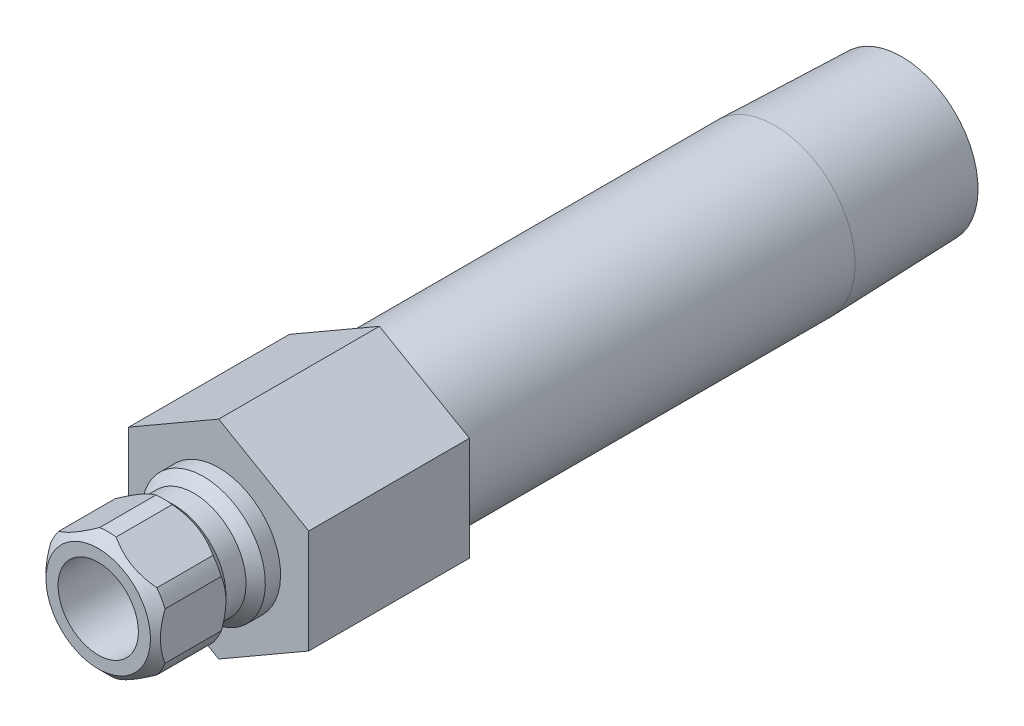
ISO-10303-21;
HEADER;
FILE_DESCRIPTION(('STEP AP214'),'2;1');
FILE_NAME('part.step','',(''),(''),'','','');
FILE_SCHEMA(('AUTOMOTIVE_DESIGN { 1 0 10303 214 1 1 1 1 }'));
ENDSEC;
DATA;
#1=APPLICATION_CONTEXT('core data for automotive mechanical design processes');
#2=APPLICATION_PROTOCOL_DEFINITION('international standard','automotive_design',2000,#1);
#3=PRODUCT_CONTEXT('',#1,'mechanical');
#4=PRODUCT('Part','Part','',(#3));
#5=PRODUCT_RELATED_PRODUCT_CATEGORY('part','',(#4));
#6=PRODUCT_DEFINITION_FORMATION('','',#4);
#7=PRODUCT_DEFINITION_CONTEXT('part definition',#1,'design');
#8=PRODUCT_DEFINITION('design','',#6,#7);
#9=PRODUCT_DEFINITION_SHAPE('','',#8);
#10=(LENGTH_UNIT() NAMED_UNIT(*) SI_UNIT(.MILLI.,.METRE.));
#11=(NAMED_UNIT(*) PLANE_ANGLE_UNIT() SI_UNIT($,.RADIAN.));
#12=(NAMED_UNIT(*) SI_UNIT($,.STERADIAN.) SOLID_ANGLE_UNIT());
#13=UNCERTAINTY_MEASURE_WITH_UNIT(LENGTH_MEASURE(1.E-05),#10,'distance_accuracy_value','');
#14=(GEOMETRIC_REPRESENTATION_CONTEXT(3) GLOBAL_UNCERTAINTY_ASSIGNED_CONTEXT((#13)) GLOBAL_UNIT_ASSIGNED_CONTEXT((#10,
#11,#12)) REPRESENTATION_CONTEXT('',''));
#15=CARTESIAN_POINT('',(0.,0.,0.));
#16=DIRECTION('',(0.,0.,1.));
#17=DIRECTION('',(1.,0.,0.));
#18=AXIS2_PLACEMENT_3D('',#15,#16,#17);
#19=CARTESIAN_POINT('',(0.,0.,0.));
#20=DIRECTION('',(0.,0.,-1.));
#21=DIRECTION('',(0.,1.,0.));
#22=AXIS2_PLACEMENT_3D('',#19,#20,#21);
#23=CYLINDRICAL_SURFACE('',#22,4.8895);
#24=DIRECTION('',(0.,0.,-1.));
#25=VECTOR('',#24,1.);
#26=CARTESIAN_POINT('',(3.87288738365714,-2.98461950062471,0.));
#27=LINE('',#26,#25);
#28=CARTESIAN_POINT('',(3.87288738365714,-2.98461950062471,4.318));
#29=VERTEX_POINT('',#28);
#30=CARTESIAN_POINT('',(3.87288738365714,-2.98461950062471,8.76299999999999));
#31=VERTEX_POINT('',#30);
#32=EDGE_CURVE('E392',#29,#31,#27,.F.);
#33=ORIENTED_EDGE('',*,*,#32,.F.);
#34=CARTESIAN_POINT('',(0.,0.,4.318));
#35=DIRECTION('',(0.,0.,-1.));
#36=DIRECTION('',(0.,1.,0.));
#37=AXIS2_PLACEMENT_3D('',#34,#35,#36);
#38=CIRCLE('',#37,4.8895);
#39=CARTESIAN_POINT('',(4.5212,-1.86170910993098,4.318));
#40=VERTEX_POINT('',#39);
#41=EDGE_CURVE('E369',#40,#29,#38,.T.);
#42=ORIENTED_EDGE('',*,*,#41,.F.);
#43=DIRECTION('',(0.,0.,-1.));
#44=VECTOR('',#43,1.);
#45=CARTESIAN_POINT('',(4.5212,-1.86170910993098,0.));
#46=LINE('',#45,#44);
#47=CARTESIAN_POINT('',(4.5212,-1.86170910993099,8.76299999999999));
#48=VERTEX_POINT('',#47);
#49=EDGE_CURVE('E383',#48,#40,#46,.T.);
#50=ORIENTED_EDGE('',*,*,#49,.F.);
#51=CARTESIAN_POINT('',(0.,0.,8.76299999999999));
#52=DIRECTION('',(0.,0.,-1.));
#53=DIRECTION('',(0.,1.,0.));
#54=AXIS2_PLACEMENT_3D('',#51,#52,#53);
#55=CIRCLE('',#54,4.8895);
#56=EDGE_CURVE('E191',#48,#31,#55,.T.);
#57=ORIENTED_EDGE('',*,*,#56,.T.);
#58=EDGE_LOOP('',(#33,#42,#50,#57));
#59=FACE_BOUND('',#58,.T.);
#60=ADVANCED_FACE('F34',(#59),#23,.T.);
#61=DIRECTION('',(0.,0.,-1.));
#62=VECTOR('',#61,1.);
#63=CARTESIAN_POINT('',(4.5212,1.86170910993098,0.));
#64=LINE('',#63,#62);
#65=CARTESIAN_POINT('',(4.5212,1.86170910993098,4.318));
#66=VERTEX_POINT('',#65);
#67=CARTESIAN_POINT('',(4.5212,1.86170910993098,8.76299999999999));
#68=VERTEX_POINT('',#67);
#69=EDGE_CURVE('E295',#66,#68,#64,.F.);
#70=ORIENTED_EDGE('',*,*,#69,.F.);
#71=CARTESIAN_POINT('',(3.87288738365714,2.98461950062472,4.318));
#72=VERTEX_POINT('',#71);
#73=EDGE_CURVE('E204',#72,#66,#38,.T.);
#74=ORIENTED_EDGE('',*,*,#73,.F.);
#75=DIRECTION('',(0.,0.,-1.));
#76=VECTOR('',#75,1.);
#77=CARTESIAN_POINT('',(3.87288738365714,2.98461950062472,0.));
#78=LINE('',#77,#76);
#79=CARTESIAN_POINT('',(3.87288738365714,2.98461950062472,8.76299999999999));
#80=VERTEX_POINT('',#79);
#81=EDGE_CURVE('E380',#80,#72,#78,.T.);
#82=ORIENTED_EDGE('',*,*,#81,.F.);
#83=EDGE_CURVE('E198',#80,#68,#55,.T.);
#84=ORIENTED_EDGE('',*,*,#83,.T.);
#85=EDGE_LOOP('',(#70,#74,#82,#84));
#86=FACE_BOUND('',#85,.T.);
#87=ADVANCED_FACE('F329',(#86),#23,.T.);
#88=DIRECTION('',(0.,0.,-1.));
#89=VECTOR('',#88,1.);
#90=CARTESIAN_POINT('',(0.648312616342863,4.84632861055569,0.));
#91=LINE('',#90,#89);
#92=CARTESIAN_POINT('',(0.648312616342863,4.84632861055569,4.318));
#93=VERTEX_POINT('',#92);
#94=CARTESIAN_POINT('',(0.648312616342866,4.84632861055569,8.76299999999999));
#95=VERTEX_POINT('',#94);
#96=EDGE_CURVE('E385',#93,#95,#91,.F.);
#97=ORIENTED_EDGE('',*,*,#96,.F.);
#98=CARTESIAN_POINT('',(-0.648312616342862,4.84632861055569,4.318));
#99=VERTEX_POINT('',#98);
#100=EDGE_CURVE('E200',#99,#93,#38,.T.);
#101=ORIENTED_EDGE('',*,*,#100,.F.);
#102=DIRECTION('',(0.,0.,-1.));
#103=VECTOR('',#102,1.);
#104=CARTESIAN_POINT('',(-0.648312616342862,4.84632861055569,0.));
#105=LINE('',#104,#103);
#106=CARTESIAN_POINT('',(-0.648312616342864,4.84632861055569,8.76299999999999));
#107=VERTEX_POINT('',#106);
#108=EDGE_CURVE('E361',#107,#99,#105,.T.);
#109=ORIENTED_EDGE('',*,*,#108,.F.);
#110=EDGE_CURVE('E193',#107,#95,#55,.T.);
#111=ORIENTED_EDGE('',*,*,#110,.T.);
#112=EDGE_LOOP('',(#97,#101,#109,#111));
#113=FACE_BOUND('',#112,.T.);
#114=ADVANCED_FACE('F334',(#113),#23,.T.);
#115=DIRECTION('',(0.,0.,-1.));
#116=VECTOR('',#115,1.);
#117=CARTESIAN_POINT('',(-3.87288738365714,2.98461950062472,0.));
#118=LINE('',#117,#116);
#119=CARTESIAN_POINT('',(-3.87288738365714,2.98461950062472,4.318));
#120=VERTEX_POINT('',#119);
#121=CARTESIAN_POINT('',(-3.87288738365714,2.98461950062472,8.76299999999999));
#122=VERTEX_POINT('',#121);
#123=EDGE_CURVE('E54',#120,#122,#118,.F.);
#124=ORIENTED_EDGE('',*,*,#123,.F.);
#125=CARTESIAN_POINT('',(-4.5212,1.86170910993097,4.318));
#126=VERTEX_POINT('',#125);
#127=EDGE_CURVE('E203',#126,#120,#38,.T.);
#128=ORIENTED_EDGE('',*,*,#127,.F.);
#129=DIRECTION('',(0.,0.,-1.));
#130=VECTOR('',#129,1.);
#131=CARTESIAN_POINT('',(-4.5212,1.86170910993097,0.));
#132=LINE('',#131,#130);
#133=CARTESIAN_POINT('',(-4.5212,1.86170910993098,8.763));
#134=VERTEX_POINT('',#133);
#135=EDGE_CURVE('E249',#134,#126,#132,.T.);
#136=ORIENTED_EDGE('',*,*,#135,.F.);
#137=EDGE_CURVE('E189',#134,#122,#55,.T.);
#138=ORIENTED_EDGE('',*,*,#137,.T.);
#139=EDGE_LOOP('',(#124,#128,#136,#138));
#140=FACE_BOUND('',#139,.T.);
#141=ADVANCED_FACE('F346',(#140),#23,.T.);
#142=DIRECTION('',(0.,0.,-1.));
#143=VECTOR('',#142,1.);
#144=CARTESIAN_POINT('',(-4.5212,-1.86170910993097,0.));
#145=LINE('',#144,#143);
#146=CARTESIAN_POINT('',(-4.5212,-1.86170910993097,4.318));
#147=VERTEX_POINT('',#146);
#148=CARTESIAN_POINT('',(-4.5212,-1.86170910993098,8.76299999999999));
#149=VERTEX_POINT('',#148);
#150=EDGE_CURVE('E62',#147,#149,#145,.F.);
#151=ORIENTED_EDGE('',*,*,#150,.F.);
#152=CARTESIAN_POINT('',(-3.87288738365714,-2.98461950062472,4.318));
#153=VERTEX_POINT('',#152);
#154=EDGE_CURVE('E182',#153,#147,#38,.T.);
#155=ORIENTED_EDGE('',*,*,#154,.F.);
#156=DIRECTION('',(0.,0.,-1.));
#157=VECTOR('',#156,1.);
#158=CARTESIAN_POINT('',(-3.87288738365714,-2.98461950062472,0.));
#159=LINE('',#158,#157);
#160=CARTESIAN_POINT('',(-3.87288738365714,-2.98461950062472,8.76299999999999));
#161=VERTEX_POINT('',#160);
#162=EDGE_CURVE('E165',#161,#153,#159,.T.);
#163=ORIENTED_EDGE('',*,*,#162,.F.);
#164=EDGE_CURVE('E180',#161,#149,#55,.T.);
#165=ORIENTED_EDGE('',*,*,#164,.T.);
#166=EDGE_LOOP('',(#151,#155,#163,#165));
#167=FACE_BOUND('',#166,.T.);
#168=ADVANCED_FACE('F179',(#167),#23,.T.);
#169=CARTESIAN_POINT('',(0.,0.,0.));
#170=DIRECTION('',(0.,0.,-1.));
#171=DIRECTION('',(0.,1.,0.));
#172=AXIS2_PLACEMENT_3D('',#169,#170,#171);
#173=CYLINDRICAL_SURFACE('',#172,6.35);
#174=CARTESIAN_POINT('',(0.,0.,-43.942));
#175=DIRECTION('',(0.,0.,-1.));
#176=DIRECTION('',(0.,1.,0.));
#177=AXIS2_PLACEMENT_3D('',#174,#175,#176);
#178=CIRCLE('',#177,6.34999999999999);
#179=CARTESIAN_POINT('',(0.,6.35,-43.942));
#180=VERTEX_POINT('',#179);
#181=EDGE_CURVE('E217',#180,#180,#178,.T.);
#182=ORIENTED_EDGE('',*,*,#181,.F.);
#183=EDGE_LOOP('',(#182));
#184=FACE_BOUND('',#183,.T.);
#185=CARTESIAN_POINT('',(0.,0.,-12.7));
#186=DIRECTION('',(0.,0.,1.));
#187=DIRECTION('',(1.,0.,0.));
#188=AXIS2_PLACEMENT_3D('',#185,#186,#187);
#189=CIRCLE('',#188,6.35);
#190=CARTESIAN_POINT('',(6.35,0.,-12.7));
#191=VERTEX_POINT('',#190);
#192=EDGE_CURVE('E438',#191,#191,#189,.F.);
#193=ORIENTED_EDGE('',*,*,#192,.T.);
#194=EDGE_LOOP('',(#193));
#195=FACE_BOUND('',#194,.T.);
#196=ADVANCED_FACE('F345',(#184,#195),#173,.T.);
#197=CARTESIAN_POINT('',(0.,6.03647060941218,-53.975));
#198=DIRECTION('',(0.,0.,-1.));
#199=DIRECTION('',(0.,1.,0.));
#200=AXIS2_PLACEMENT_3D('',#197,#198,#199);
#201=PLANE('',#200);
#202=CARTESIAN_POINT('',(0.,0.,-53.975));
#203=DIRECTION('',(0.,0.,-1.));
#204=DIRECTION('',(0.,1.,0.));
#205=AXIS2_PLACEMENT_3D('',#202,#203,#204);
#206=CIRCLE('',#205,6.03647060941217);
#207=CARTESIAN_POINT('',(0.,6.03647060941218,-53.975));
#208=VERTEX_POINT('',#207);
#209=EDGE_CURVE('E174',#208,#208,#206,.T.);
#210=ORIENTED_EDGE('',*,*,#209,.T.);
#211=EDGE_LOOP('',(#210));
#212=FACE_BOUND('',#211,.T.);
#213=CARTESIAN_POINT('',(0.,0.,-53.975));
#214=DIRECTION('',(0.,0.,-1.));
#215=DIRECTION('',(0.,1.,0.));
#216=AXIS2_PLACEMENT_3D('',#213,#214,#215);
#217=CIRCLE('',#216,4.62279999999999);
#218=CARTESIAN_POINT('',(0.,4.6228,-53.975));
#219=VERTEX_POINT('',#218);
#220=EDGE_CURVE('E450',#219,#219,#217,.T.);
#221=ORIENTED_EDGE('',*,*,#220,.F.);
#222=EDGE_LOOP('',(#221));
#223=FACE_BOUND('',#222,.T.);
#224=ADVANCED_FACE('F36',(#212,#223),#201,.T.);
#225=CARTESIAN_POINT('',(0.,0.,-53.975));
#226=DIRECTION('',(0.,0.,1.));
#227=DIRECTION('',(0.,-1.,0.));
#228=AXIS2_PLACEMENT_3D('',#225,#226,#227);
#229=CONICAL_SURFACE('',#228,6.03647060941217,0.0312396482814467);
#230=ORIENTED_EDGE('',*,*,#181,.T.);
#231=EDGE_LOOP('',(#230));
#232=FACE_BOUND('',#231,.T.);
#233=ORIENTED_EDGE('',*,*,#209,.F.);
#234=EDGE_LOOP('',(#233));
#235=FACE_BOUND('',#234,.T.);
#236=ADVANCED_FACE('F526',(#232,#235),#229,.T.);
#237=CARTESIAN_POINT('',(0.,4.8895,0.));
#238=DIRECTION('',(0.,0.,1.));
#239=DIRECTION('',(0.,-1.,0.));
#240=AXIS2_PLACEMENT_3D('',#237,#238,#239);
#241=PLANE('',#240);
#242=CARTESIAN_POINT('',(0.,0.,0.));
#243=DIRECTION('',(0.,0.,-1.));
#244=DIRECTION('',(0.,1.,0.));
#245=AXIS2_PLACEMENT_3D('',#242,#243,#244);
#246=CIRCLE('',#245,4.8895);
#247=CARTESIAN_POINT('',(0.,4.8895,0.));
#248=VERTEX_POINT('',#247);
#249=EDGE_CURVE('E214',#248,#248,#246,.T.);
#250=ORIENTED_EDGE('',*,*,#249,.T.);
#251=EDGE_LOOP('',(#250));
#252=FACE_BOUND('',#251,.T.);
#253=DIRECTION('',(-0.866025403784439,-0.5,0.));
#254=VECTOR('',#253,1.);
#255=CARTESIAN_POINT('',(0.,8.21223022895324,0.));
#256=LINE('',#255,#254);
#257=CARTESIAN_POINT('',(0.,8.21223022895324,0.));
#258=VERTEX_POINT('',#257);
#259=CARTESIAN_POINT('',(-7.112,4.10611511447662,0.));
#260=VERTEX_POINT('',#259);
#261=EDGE_CURVE('E395',#258,#260,#256,.T.);
#262=ORIENTED_EDGE('',*,*,#261,.T.);
#263=DIRECTION('',(0.,-1.,0.));
#264=VECTOR('',#263,1.);
#265=CARTESIAN_POINT('',(-7.112,4.10611511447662,0.));
#266=LINE('',#265,#264);
#267=CARTESIAN_POINT('',(-7.112,-4.10611511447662,0.));
#268=VERTEX_POINT('',#267);
#269=EDGE_CURVE('E422',#260,#268,#266,.T.);
#270=ORIENTED_EDGE('',*,*,#269,.T.);
#271=DIRECTION('',(0.866025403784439,-0.5,0.));
#272=VECTOR('',#271,1.);
#273=CARTESIAN_POINT('',(-7.112,-4.10611511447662,0.));
#274=LINE('',#273,#272);
#275=CARTESIAN_POINT('',(0.,-8.21223022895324,0.));
#276=VERTEX_POINT('',#275);
#277=EDGE_CURVE('E425',#268,#276,#274,.T.);
#278=ORIENTED_EDGE('',*,*,#277,.T.);
#279=DIRECTION('',(0.866025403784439,0.5,0.));
#280=VECTOR('',#279,1.);
#281=CARTESIAN_POINT('',(0.,-8.21223022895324,0.));
#282=LINE('',#281,#280);
#283=CARTESIAN_POINT('',(7.112,-4.10611511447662,0.));
#284=VERTEX_POINT('',#283);
#285=EDGE_CURVE('E428',#276,#284,#282,.T.);
#286=ORIENTED_EDGE('',*,*,#285,.T.);
#287=DIRECTION('',(0.,1.,0.));
#288=VECTOR('',#287,1.);
#289=CARTESIAN_POINT('',(7.112,-4.10611511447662,0.));
#290=LINE('',#289,#288);
#291=CARTESIAN_POINT('',(7.112,4.10611511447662,0.));
#292=VERTEX_POINT('',#291);
#293=EDGE_CURVE('E431',#284,#292,#290,.T.);
#294=ORIENTED_EDGE('',*,*,#293,.T.);
#295=DIRECTION('',(-0.866025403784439,0.5,0.));
#296=VECTOR('',#295,1.);
#297=CARTESIAN_POINT('',(7.112,4.10611511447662,0.));
#298=LINE('',#297,#296);
#299=EDGE_CURVE('E404',#292,#258,#298,.T.);
#300=ORIENTED_EDGE('',*,*,#299,.T.);
#301=EDGE_LOOP('',(#262,#270,#278,#286,#294,#300));
#302=FACE_BOUND('',#301,.T.);
#303=ADVANCED_FACE('F523',(#252,#302),#241,.T.);
#304=CARTESIAN_POINT('',(0.,0.,0.));
#305=DIRECTION('',(0.,0.,-1.));
#306=DIRECTION('',(0.,1.,0.));
#307=AXIS2_PLACEMENT_3D('',#304,#305,#306);
#308=CYLINDRICAL_SURFACE('',#307,4.8895);
#309=CARTESIAN_POINT('',(0.,0.,1.2065));
#310=DIRECTION('',(0.,0.,-1.));
#311=DIRECTION('',(0.,1.,0.));
#312=AXIS2_PLACEMENT_3D('',#309,#310,#311);
#313=CIRCLE('',#312,4.8895);
#314=CARTESIAN_POINT('',(0.,4.8895,1.2065));
#315=VERTEX_POINT('',#314);
#316=EDGE_CURVE('E211',#315,#315,#313,.T.);
#317=ORIENTED_EDGE('',*,*,#316,.T.);
#318=EDGE_LOOP('',(#317));
#319=FACE_BOUND('',#318,.T.);
#320=ORIENTED_EDGE('',*,*,#249,.F.);
#321=EDGE_LOOP('',(#320));
#322=FACE_BOUND('',#321,.T.);
#323=ADVANCED_FACE('F525',(#319,#322),#308,.T.);
#324=CARTESIAN_POINT('',(0.,0.,1.2065));
#325=DIRECTION('',(0.,0.,-1.));
#326=DIRECTION('',(0.,1.,0.));
#327=AXIS2_PLACEMENT_3D('',#324,#325,#326);
#328=CONICAL_SURFACE('',#327,4.8895,0.785398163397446);
#329=CARTESIAN_POINT('',(0.,0.,1.9685));
#330=DIRECTION('',(0.,0.,-1.));
#331=DIRECTION('',(0.,1.,0.));
#332=AXIS2_PLACEMENT_3D('',#329,#330,#331);
#333=CIRCLE('',#332,4.1275);
#334=CARTESIAN_POINT('',(0.,4.1275,1.9685));
#335=VERTEX_POINT('',#334);
#336=EDGE_CURVE('E208',#335,#335,#333,.T.);
#337=ORIENTED_EDGE('',*,*,#336,.T.);
#338=EDGE_LOOP('',(#337));
#339=FACE_BOUND('',#338,.T.);
#340=ORIENTED_EDGE('',*,*,#316,.F.);
#341=EDGE_LOOP('',(#340));
#342=FACE_BOUND('',#341,.T.);
#343=ADVANCED_FACE('F533',(#339,#342),#328,.T.);
#344=CARTESIAN_POINT('',(0.,0.,0.));
#345=DIRECTION('',(0.,0.,-1.));
#346=DIRECTION('',(0.,1.,0.));
#347=AXIS2_PLACEMENT_3D('',#344,#345,#346);
#348=CYLINDRICAL_SURFACE('',#347,4.1275);
#349=CARTESIAN_POINT('',(0.,0.,3.556));
#350=DIRECTION('',(0.,0.,-1.));
#351=DIRECTION('',(0.,1.,0.));
#352=AXIS2_PLACEMENT_3D('',#349,#350,#351);
#353=CIRCLE('',#352,4.1275);
#354=CARTESIAN_POINT('',(0.,4.1275,3.556));
#355=VERTEX_POINT('',#354);
#356=EDGE_CURVE('E205',#355,#355,#353,.T.);
#357=ORIENTED_EDGE('',*,*,#356,.T.);
#358=EDGE_LOOP('',(#357));
#359=FACE_BOUND('',#358,.T.);
#360=ORIENTED_EDGE('',*,*,#336,.F.);
#361=EDGE_LOOP('',(#360));
#362=FACE_BOUND('',#361,.T.);
#363=ADVANCED_FACE('F256',(#359,#362),#348,.T.);
#364=CARTESIAN_POINT('',(0.,0.,3.556));
#365=DIRECTION('',(0.,0.,1.));
#366=DIRECTION('',(0.,-1.,0.));
#367=AXIS2_PLACEMENT_3D('',#364,#365,#366);
#368=CONICAL_SURFACE('',#367,4.1275,0.785398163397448);
#369=CARTESIAN_POINT('',(0.64785777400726,-4.84659121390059,4.3182));
#370=CARTESIAN_POINT('',(0.775261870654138,-4.77303442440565,4.26213711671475));
#371=CARTESIAN_POINT('',(0.904457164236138,-4.69844348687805,4.21102627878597));
#372=CARTESIAN_POINT('',(1.16629518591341,-4.5472712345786,4.12074318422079));
#373=CARTESIAN_POINT('',(1.2989462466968,-4.47068510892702,4.08160338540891));
#374=CARTESIAN_POINT('',(1.56203676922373,-4.31878972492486,4.01877592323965));
#375=CARTESIAN_POINT('',(1.69238331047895,-4.24353411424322,3.99458163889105));
#376=CARTESIAN_POINT('',(1.95434729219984,-4.09228913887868,3.96102228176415));
#377=CARTESIAN_POINT('',(2.0859628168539,-4.01630088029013,3.951637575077));
#378=CARTESIAN_POINT('',(2.35623055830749,-3.86026172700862,3.9482192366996));
#379=CARTESIAN_POINT('',(2.49489129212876,-3.78020591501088,3.95501290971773));
#380=CARTESIAN_POINT('',(2.77103341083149,-3.62077518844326,3.98518499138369));
#381=CARTESIAN_POINT('',(2.90851272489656,-3.54140146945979,4.00858815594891));
#382=CARTESIAN_POINT('',(3.18622016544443,-3.38106700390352,4.07155129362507));
#383=CARTESIAN_POINT('',(3.32634361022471,-3.30016669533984,4.11171074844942));
#384=CARTESIAN_POINT('',(3.60275664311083,-3.14057955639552,4.20550294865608));
#385=CARTESIAN_POINT('',(3.73905611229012,-3.06188702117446,4.25909654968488));
#386=CARTESIAN_POINT('',(3.87334222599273,-2.98435689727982,4.3182));
#387=B_SPLINE_CURVE_WITH_KNOTS('',3,(#369,#370,#371,#372,#373,#374,#375,#376,#377,#378,#379,
#380,#381,#382,#383,#384,#385,#386),.UNSPECIFIED.,.F.,.F.,(4,2,2,2,2,2,2,2,4),(0.,
0.472469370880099,0.946208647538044,1.40285320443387,1.85889185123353,2.33874707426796,
2.81931901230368,3.31879975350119,3.81684169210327),.UNSPECIFIED.);
#388=CARTESIAN_POINT('',(0.648312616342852,-4.84632861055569,4.318));
#389=VERTEX_POINT('',#388);
#390=EDGE_CURVE('E394',#389,#29,#387,.T.);
#391=ORIENTED_EDGE('',*,*,#390,.F.);
#392=CARTESIAN_POINT('',(-0.648312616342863,-4.84632861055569,4.318));
#393=VERTEX_POINT('',#392);
#394=EDGE_CURVE('E367',#389,#393,#38,.T.);
#395=ORIENTED_EDGE('',*,*,#394,.T.);
#396=CARTESIAN_POINT('',(-3.87334222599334,-2.98435689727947,4.31820000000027));
#397=CARTESIAN_POINT('',(-3.74593812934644,-3.05791368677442,4.26213711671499));
#398=CARTESIAN_POINT('',(-3.61674283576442,-3.13250462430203,4.21102627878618));
#399=CARTESIAN_POINT('',(-3.35490481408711,-3.28367687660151,4.12074318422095));
#400=CARTESIAN_POINT('',(-3.22225375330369,-3.3602630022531,4.08160338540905));
#401=CARTESIAN_POINT('',(-2.95916323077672,-3.51215838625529,4.01877592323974));
#402=CARTESIAN_POINT('',(-2.82881668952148,-3.58741399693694,3.99458163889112));
#403=CARTESIAN_POINT('',(-2.56685270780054,-3.73865897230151,3.96102228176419));
#404=CARTESIAN_POINT('',(-2.43523718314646,-3.81464723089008,3.95163757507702));
#405=CARTESIAN_POINT('',(-2.16496944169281,-3.97068638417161,3.94821923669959));
#406=CARTESIAN_POINT('',(-2.02630870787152,-4.05074219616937,3.95501290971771));
#407=CARTESIAN_POINT('',(-1.75016658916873,-4.21017292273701,3.98518499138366));
#408=CARTESIAN_POINT('',(-1.61268727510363,-4.28954664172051,4.00858815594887));
#409=CARTESIAN_POINT('',(-1.33497983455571,-4.44988110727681,4.07155129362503));
#410=CARTESIAN_POINT('',(-1.1948563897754,-4.5307814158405,4.11171074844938));
#411=CARTESIAN_POINT('',(-0.918443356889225,-4.69036855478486,4.20550294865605));
#412=CARTESIAN_POINT('',(-0.782143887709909,-4.76906109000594,4.25909654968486));
#413=CARTESIAN_POINT('',(-0.647857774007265,-4.84659121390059,4.3182));
#414=B_SPLINE_CURVE_WITH_KNOTS('',3,(#396,#397,#398,#399,#400,#401,#402,#403,#404,#405,#406,
#407,#408,#409,#410,#411,#412,#413),.UNSPECIFIED.,.F.,.F.,(4,2,2,2,2,2,2,2,4),(0.,
0.472469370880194,0.946208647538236,1.40285320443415,1.85889185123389,2.33874707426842,
2.81931901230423,3.31879975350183,3.81684169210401),.UNSPECIFIED.);
#415=EDGE_CURVE('E242',#153,#393,#414,.T.);
#416=ORIENTED_EDGE('',*,*,#415,.F.);
#417=ORIENTED_EDGE('',*,*,#154,.T.);
#418=CARTESIAN_POINT('',(-4.5212,-5.15925306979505,6.2884665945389));
#419=CARTESIAN_POINT('',(-4.5212,-5.03341781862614,6.19384981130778));
#420=CARTESIAN_POINT('',(-4.5212,-4.90687282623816,6.10016148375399));
#421=CARTESIAN_POINT('',(-4.5212,-4.65208542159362,5.91505573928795));
#422=CARTESIAN_POINT('',(-4.5212,-4.52384258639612,5.82363890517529));
#423=CARTESIAN_POINT('',(-4.5212,-4.26444371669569,5.64284060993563));
#424=CARTESIAN_POINT('',(-4.5212,-4.13327280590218,5.55348041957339));
#425=CARTESIAN_POINT('',(-4.5212,-3.86869655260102,5.37814219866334));
#426=CARTESIAN_POINT('',(-4.5212,-3.735291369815,5.29216392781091));
#427=CARTESIAN_POINT('',(-4.5212,-3.45835736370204,5.1196421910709));
#428=CARTESIAN_POINT('',(-4.5212,-3.31467977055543,5.03333631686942));
#429=CARTESIAN_POINT('',(-4.5212,-3.02397608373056,4.86646929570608));
#430=CARTESIAN_POINT('',(-4.5212,-2.87694947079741,4.78590904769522));
#431=CARTESIAN_POINT('',(-4.5212,-2.57957206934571,4.6322757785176));
#432=CARTESIAN_POINT('',(-4.5212,-2.42923274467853,4.55918074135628));
#433=CARTESIAN_POINT('',(-4.5212,-2.12448469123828,4.4221138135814));
#434=CARTESIAN_POINT('',(-4.5212,-1.97007782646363,4.35813782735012));
#435=CARTESIAN_POINT('',(-4.5212,-1.66898205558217,4.24604782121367));
#436=CARTESIAN_POINT('',(-4.5212,-1.52260919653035,4.19709368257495));
#437=CARTESIAN_POINT('',(-4.5212,-1.22638031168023,4.11093488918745));
#438=CARTESIAN_POINT('',(-4.5212,-1.07652404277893,4.07373105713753));
#439=CARTESIAN_POINT('',(-4.5212,-0.776693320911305,4.01362130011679));
#440=CARTESIAN_POINT('',(-4.5212,-0.6267682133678,3.99047322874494));
#441=CARTESIAN_POINT('',(-4.5212,-0.32536672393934,3.95891692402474));
#442=CARTESIAN_POINT('',(-4.5212,-0.173890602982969,3.95050625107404));
#443=CARTESIAN_POINT('',(-4.5212,0.123852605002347,3.94903068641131));
#444=CARTESIAN_POINT('',(-4.5212,0.270117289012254,3.95544130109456));
#445=CARTESIAN_POINT('',(-4.5212,0.561370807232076,3.98210770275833));
#446=CARTESIAN_POINT('',(-4.5212,0.706359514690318,4.00236484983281));
#447=CARTESIAN_POINT('',(-4.5212,0.996462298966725,4.05597163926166));
#448=CARTESIAN_POINT('',(-4.5212,1.14153485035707,4.08954247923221));
#449=CARTESIAN_POINT('',(-4.5212,1.42852462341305,4.16800024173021));
#450=CARTESIAN_POINT('',(-4.5212,1.5704421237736,4.21288616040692));
#451=CARTESIAN_POINT('',(-4.5212,1.86505501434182,4.3171412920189));
#452=CARTESIAN_POINT('',(-4.5212,2.01739126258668,4.37751543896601));
#453=CARTESIAN_POINT('',(-4.5212,2.31809735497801,4.5075182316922));
#454=CARTESIAN_POINT('',(-4.5212,2.46646529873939,4.57715121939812));
#455=CARTESIAN_POINT('',(-4.5212,2.75996557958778,4.72401353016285));
#456=CARTESIAN_POINT('',(-4.5212,2.90508583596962,4.80126680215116));
#457=CARTESIAN_POINT('',(-4.5212,3.19198335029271,4.96166050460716));
#458=CARTESIAN_POINT('',(-4.5212,3.33376113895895,5.04479999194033));
#459=CARTESIAN_POINT('',(-4.5212,3.6074215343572,5.21154136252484));
#460=CARTESIAN_POINT('',(-4.5212,3.73944496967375,5.29491333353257));
#461=CARTESIAN_POINT('',(-4.5212,4.00122581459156,5.46515273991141));
#462=CARTESIAN_POINT('',(-4.5212,4.13098305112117,5.55202044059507));
#463=CARTESIAN_POINT('',(-4.5212,4.38747396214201,5.7279062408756));
#464=CARTESIAN_POINT('',(-4.5212,4.51422365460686,5.81690106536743));
#465=CARTESIAN_POINT('',(-4.5212,4.76599253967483,5.99723636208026));
#466=CARTESIAN_POINT('',(-4.5212,4.89101219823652,6.08857618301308));
#467=CARTESIAN_POINT('',(-4.5212,5.01530771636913,6.18087446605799));
#468=B_SPLINE_CURVE_WITH_KNOTS('',3,(#418,#419,#420,#421,#422,#423,#424,#425,#426,#427,#428,
#429,#430,#431,#432,#433,#434,#435,#436,#437,#438,#439,#440,#441,#442,#443,#444,#445,#446,#447,
#448,#449,#450,#451,#452,#453,#454,#455,#456,#457,#458,#459,#460,#461,#462,#463,#464,#465,#466,
#467),.UNSPECIFIED.,.F.,.F.,(4,2,2,2,2,2,2,2,2,2,2,2,2,2,2,2,2,2,2,2,2,2,2,2,4),(0.,
0.472324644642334,0.944769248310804,1.42087610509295,1.89694907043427,2.39966187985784,
2.90245317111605,3.40371602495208,3.90475303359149,4.36737130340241,4.8300219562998,
5.28445770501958,5.73881822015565,6.17734710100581,6.61591906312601,7.06210522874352,
7.50825182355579,7.99945943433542,8.49089821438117,8.98393391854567,9.4768908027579,
9.94525924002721,10.4136632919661,10.8782525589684,11.3427141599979),.UNSPECIFIED.);
#469=EDGE_CURVE('E265',#126,#147,#468,.F.);
#470=ORIENTED_EDGE('',*,*,#469,.F.);
#471=ORIENTED_EDGE('',*,*,#127,.T.);
#472=CARTESIAN_POINT('',(-0.647857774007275,4.84659121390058,4.3182));
#473=CARTESIAN_POINT('',(-0.775261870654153,4.77303442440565,4.26213711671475));
#474=CARTESIAN_POINT('',(-0.904457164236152,4.69844348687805,4.21102627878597));
#475=CARTESIAN_POINT('',(-1.16629518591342,4.5472712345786,4.12074318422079));
#476=CARTESIAN_POINT('',(-1.29894624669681,4.47068510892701,4.08160338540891));
#477=CARTESIAN_POINT('',(-1.56203676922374,4.31878972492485,4.01877592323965));
#478=CARTESIAN_POINT('',(-1.69238331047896,4.24353411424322,3.99458163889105));
#479=CARTESIAN_POINT('',(-1.95434729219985,4.09228913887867,3.96102228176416));
#480=CARTESIAN_POINT('',(-2.0859628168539,4.01630088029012,3.95163757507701));
#481=CARTESIAN_POINT('',(-2.35623055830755,3.86026172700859,3.94821923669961));
#482=CARTESIAN_POINT('',(-2.49489129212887,3.78020591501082,3.95501290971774));
#483=CARTESIAN_POINT('',(-2.7710334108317,3.62077518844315,3.98518499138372));
#484=CARTESIAN_POINT('',(-2.90851272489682,3.54140146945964,4.00858815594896));
#485=CARTESIAN_POINT('',(-3.18622016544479,3.38106700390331,4.07155129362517));
#486=CARTESIAN_POINT('',(-3.32634361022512,3.30016669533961,4.11171074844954));
#487=CARTESIAN_POINT('',(-3.60275664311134,3.14057955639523,4.20550294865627));
#488=CARTESIAN_POINT('',(-3.73905611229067,3.06188702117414,4.2590965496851));
#489=CARTESIAN_POINT('',(-3.87334222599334,2.98435689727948,4.31820000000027));
#490=B_SPLINE_CURVE_WITH_KNOTS('',3,(#472,#473,#474,#475,#476,#477,#478,#479,#480,#481,#482,
#483,#484,#485,#486,#487,#488,#489),.UNSPECIFIED.,.F.,.F.,(4,2,2,2,2,2,2,2,4),(0.,
0.472469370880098,0.946208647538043,1.40285320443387,1.85889185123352,2.33874707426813,
2.81931901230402,3.31879975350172,3.81684169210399),.UNSPECIFIED.);
#491=EDGE_CURVE('E272',#99,#120,#490,.T.);
#492=ORIENTED_EDGE('',*,*,#491,.F.);
#493=ORIENTED_EDGE('',*,*,#100,.T.);
#494=CARTESIAN_POINT('',(3.87334222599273,2.98435689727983,4.3182));
#495=CARTESIAN_POINT('',(3.74593812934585,3.05791368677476,4.26213711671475));
#496=CARTESIAN_POINT('',(3.61674283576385,3.13250462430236,4.21102627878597));
#497=CARTESIAN_POINT('',(3.35490481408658,3.28367687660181,4.12074318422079));
#498=CARTESIAN_POINT('',(3.22225375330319,3.36026300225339,4.08160338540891));
#499=CARTESIAN_POINT('',(2.95916323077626,3.51215838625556,4.01877592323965));
#500=CARTESIAN_POINT('',(2.82881668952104,3.58741399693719,3.99458163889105));
#501=CARTESIAN_POINT('',(2.56685270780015,3.73865897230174,3.96102228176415));
#502=CARTESIAN_POINT('',(2.4352371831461,3.81464723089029,3.95163757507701));
#503=CARTESIAN_POINT('',(2.16496944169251,3.97068638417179,3.94821923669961));
#504=CARTESIAN_POINT('',(2.02630870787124,4.05074219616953,3.95501290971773));
#505=CARTESIAN_POINT('',(1.75016658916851,4.21017292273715,3.98518499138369));
#506=CARTESIAN_POINT('',(1.61268727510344,4.28954664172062,4.00858815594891));
#507=CARTESIAN_POINT('',(1.33497983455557,4.44988110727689,4.07155129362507));
#508=CARTESIAN_POINT('',(1.19485638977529,4.53078141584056,4.11171074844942));
#509=CARTESIAN_POINT('',(0.918443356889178,4.69036855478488,4.20550294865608));
#510=CARTESIAN_POINT('',(0.78214388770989,4.76906109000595,4.25909654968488));
#511=CARTESIAN_POINT('',(0.647857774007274,4.84659121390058,4.3182));
#512=B_SPLINE_CURVE_WITH_KNOTS('',3,(#494,#495,#496,#497,#498,#499,#500,#501,#502,#503,#504,
#505,#506,#507,#508,#509,#510,#511),.UNSPECIFIED.,.F.,.F.,(4,2,2,2,2,2,2,2,4),(0.,
0.472469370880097,0.946208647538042,1.40285320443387,1.85889185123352,2.33874707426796,
2.81931901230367,3.31879975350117,3.81684169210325),.UNSPECIFIED.);
#513=EDGE_CURVE('E279',#72,#93,#512,.T.);
#514=ORIENTED_EDGE('',*,*,#513,.F.);
#515=ORIENTED_EDGE('',*,*,#73,.T.);
#516=CARTESIAN_POINT('',(4.5212,-5.15925306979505,6.2884665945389));
#517=CARTESIAN_POINT('',(4.5212,-5.03341781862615,6.19384981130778));
#518=CARTESIAN_POINT('',(4.5212,-4.90687282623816,6.10016148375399));
#519=CARTESIAN_POINT('',(4.5212,-4.65208542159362,5.91505573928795));
#520=CARTESIAN_POINT('',(4.5212,-4.52384258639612,5.82363890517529));
#521=CARTESIAN_POINT('',(4.5212,-4.26444371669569,5.64284060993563));
#522=CARTESIAN_POINT('',(4.5212,-4.13327280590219,5.55348041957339));
#523=CARTESIAN_POINT('',(4.5212,-3.86869655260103,5.37814219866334));
#524=CARTESIAN_POINT('',(4.5212,-3.735291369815,5.29216392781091));
#525=CARTESIAN_POINT('',(4.5212,-3.45835736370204,5.1196421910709));
#526=CARTESIAN_POINT('',(4.5212,-3.31467977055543,5.03333631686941));
#527=CARTESIAN_POINT('',(4.5212,-3.02397608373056,4.86646929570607));
#528=CARTESIAN_POINT('',(4.5212,-2.87694947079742,4.78590904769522));
#529=CARTESIAN_POINT('',(4.5212,-2.57957206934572,4.6322757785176));
#530=CARTESIAN_POINT('',(4.5212,-2.42923274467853,4.55918074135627));
#531=CARTESIAN_POINT('',(4.5212,-2.12448469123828,4.4221138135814));
#532=CARTESIAN_POINT('',(4.5212,-1.97007782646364,4.35813782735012));
#533=CARTESIAN_POINT('',(4.5212,-1.66898205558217,4.24604782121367));
#534=CARTESIAN_POINT('',(4.5212,-1.52260919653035,4.19709368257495));
#535=CARTESIAN_POINT('',(4.5212,-1.22638031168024,4.11093488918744));
#536=CARTESIAN_POINT('',(4.5212,-1.07652404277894,4.07373105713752));
#537=CARTESIAN_POINT('',(4.5212,-0.776693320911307,4.01362130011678));
#538=CARTESIAN_POINT('',(4.5212,-0.626768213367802,3.99047322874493));
#539=CARTESIAN_POINT('',(4.5212,-0.325366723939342,3.95891692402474));
#540=CARTESIAN_POINT('',(4.5212,-0.173890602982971,3.95050625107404));
#541=CARTESIAN_POINT('',(4.5212,0.123852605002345,3.94903068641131));
#542=CARTESIAN_POINT('',(4.5212,0.270117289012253,3.95544130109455));
#543=CARTESIAN_POINT('',(4.5212,0.561370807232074,3.98210770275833));
#544=CARTESIAN_POINT('',(4.5212,0.706359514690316,4.0023648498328));
#545=CARTESIAN_POINT('',(4.5212,0.996462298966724,4.05597163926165));
#546=CARTESIAN_POINT('',(4.5212,1.14153485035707,4.08954247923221));
#547=CARTESIAN_POINT('',(4.5212,1.42852462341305,4.16800024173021));
#548=CARTESIAN_POINT('',(4.5212,1.5704421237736,4.21288616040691));
#549=CARTESIAN_POINT('',(4.5212,1.86505501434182,4.3171412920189));
#550=CARTESIAN_POINT('',(4.5212,2.01739126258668,4.37751543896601));
#551=CARTESIAN_POINT('',(4.5212,2.31809735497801,4.5075182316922));
#552=CARTESIAN_POINT('',(4.5212,2.46646529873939,4.57715121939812));
#553=CARTESIAN_POINT('',(4.5212,2.75996557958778,4.72401353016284));
#554=CARTESIAN_POINT('',(4.5212,2.90508583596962,4.80126680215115));
#555=CARTESIAN_POINT('',(4.5212,3.19198335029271,4.96166050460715));
#556=CARTESIAN_POINT('',(4.5212,3.33376113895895,5.04479999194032));
#557=CARTESIAN_POINT('',(4.5212,3.6074215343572,5.21154136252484));
#558=CARTESIAN_POINT('',(4.5212,3.73944496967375,5.29491333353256));
#559=CARTESIAN_POINT('',(4.5212,4.00122581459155,5.4651527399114));
#560=CARTESIAN_POINT('',(4.5212,4.13098305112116,5.55202044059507));
#561=CARTESIAN_POINT('',(4.5212,4.38747396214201,5.72790624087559));
#562=CARTESIAN_POINT('',(4.5212,4.51422365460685,5.81690106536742));
#563=CARTESIAN_POINT('',(4.5212,4.76599253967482,5.99723636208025));
#564=CARTESIAN_POINT('',(4.5212,4.89101219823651,6.08857618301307));
#565=CARTESIAN_POINT('',(4.5212,5.01530771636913,6.18087446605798));
#566=B_SPLINE_CURVE_WITH_KNOTS('',3,(#516,#517,#518,#519,#520,#521,#522,#523,#524,#525,#526,
#527,#528,#529,#530,#531,#532,#533,#534,#535,#536,#537,#538,#539,#540,#541,#542,#543,#544,#545,
#546,#547,#548,#549,#550,#551,#552,#553,#554,#555,#556,#557,#558,#559,#560,#561,#562,#563,#564,
#565),.UNSPECIFIED.,.F.,.F.,(4,2,2,2,2,2,2,2,2,2,2,2,2,2,2,2,2,2,2,2,2,2,2,2,4),(0.,
0.472324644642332,0.944769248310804,1.42087610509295,1.89694907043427,2.39966187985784,
2.90245317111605,3.40371602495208,3.90475303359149,4.36737130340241,4.8300219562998,
5.28445770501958,5.73881822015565,6.17734710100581,6.61591906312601,7.06210522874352,
7.50825182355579,7.99945943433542,8.49089821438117,8.98393391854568,9.47689080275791,
9.94525924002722,10.4136632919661,10.8782525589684,11.3427141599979),.UNSPECIFIED.);
#567=EDGE_CURVE('E287',#40,#66,#566,.T.);
#568=ORIENTED_EDGE('',*,*,#567,.F.);
#569=ORIENTED_EDGE('',*,*,#41,.T.);
#570=EDGE_LOOP('',(#391,#395,#416,#417,#470,#471,#492,#493,#514,#515,#568,#569));
#571=FACE_BOUND('',#570,.T.);
#572=ORIENTED_EDGE('',*,*,#356,.F.);
#573=EDGE_LOOP('',(#572));
#574=FACE_BOUND('',#573,.T.);
#575=ADVANCED_FACE('F251',(#571,#574),#368,.T.);
#576=DIRECTION('',(0.,0.,-1.));
#577=VECTOR('',#576,1.);
#578=CARTESIAN_POINT('',(0.648312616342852,-4.84632861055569,0.));
#579=LINE('',#578,#577);
#580=CARTESIAN_POINT('',(0.648312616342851,-4.84632861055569,8.76299999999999));
#581=VERTEX_POINT('',#580);
#582=EDGE_CURVE('E294',#581,#389,#579,.T.);
#583=ORIENTED_EDGE('',*,*,#582,.F.);
#584=CARTESIAN_POINT('',(-0.648312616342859,-4.84632861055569,8.76299999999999));
#585=VERTEX_POINT('',#584);
#586=EDGE_CURVE('E188',#581,#585,#55,.T.);
#587=ORIENTED_EDGE('',*,*,#586,.T.);
#588=DIRECTION('',(0.,0.,-1.));
#589=VECTOR('',#588,1.);
#590=CARTESIAN_POINT('',(-0.648312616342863,-4.84632861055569,0.));
#591=LINE('',#590,#589);
#592=EDGE_CURVE('E168',#393,#585,#591,.F.);
#593=ORIENTED_EDGE('',*,*,#592,.F.);
#594=ORIENTED_EDGE('',*,*,#394,.F.);
#595=EDGE_LOOP('',(#583,#587,#593,#594));
#596=FACE_BOUND('',#595,.T.);
#597=ADVANCED_FACE('F255',(#596),#23,.T.);
#598=CARTESIAN_POINT('',(0.,0.,8.76299999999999));
#599=DIRECTION('',(0.,0.,-1.));
#600=DIRECTION('',(0.,1.,0.));
#601=AXIS2_PLACEMENT_3D('',#598,#599,#600);
#602=CONICAL_SURFACE('',#601,4.8895,0.785398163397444);
#603=CARTESIAN_POINT('',(3.87334222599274,-2.98435689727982,8.7628));
#604=CARTESIAN_POINT('',(3.74593812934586,-3.05791368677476,8.81886288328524));
#605=CARTESIAN_POINT('',(3.61674283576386,-3.13250462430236,8.86997372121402));
#606=CARTESIAN_POINT('',(3.35490481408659,-3.28367687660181,8.9602568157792));
#607=CARTESIAN_POINT('',(3.2222537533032,-3.36026300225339,8.99939661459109));
#608=CARTESIAN_POINT('',(2.95916323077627,-3.51215838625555,9.06222407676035));
#609=CARTESIAN_POINT('',(2.82881668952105,-3.58741399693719,9.08641836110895));
#610=CARTESIAN_POINT('',(2.56685270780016,-3.73865897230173,9.11997771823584));
#611=CARTESIAN_POINT('',(2.43523718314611,-3.81464723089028,9.12936242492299));
#612=CARTESIAN_POINT('',(2.16496944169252,-3.97068638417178,9.1327807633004));
#613=CARTESIAN_POINT('',(2.02630870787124,-4.05074219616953,9.12598709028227));
#614=CARTESIAN_POINT('',(1.75016658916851,-4.21017292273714,9.09581500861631));
#615=CARTESIAN_POINT('',(1.61268727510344,-4.28954664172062,9.07241184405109));
#616=CARTESIAN_POINT('',(1.33497983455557,-4.44988110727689,9.00944870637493));
#617=CARTESIAN_POINT('',(1.19485638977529,-4.53078141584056,8.96928925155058));
#618=CARTESIAN_POINT('',(0.91844335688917,-4.69036855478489,8.87549705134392));
#619=CARTESIAN_POINT('',(0.782143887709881,-4.76906109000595,8.82190345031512));
#620=CARTESIAN_POINT('',(0.647857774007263,-4.84659121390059,8.7628));
#621=B_SPLINE_CURVE_WITH_KNOTS('',3,(#603,#604,#605,#606,#607,#608,#609,#610,#611,#612,#613,
#614,#615,#616,#617,#618,#619,#620),.UNSPECIFIED.,.F.,.F.,(4,2,2,2,2,2,2,2,4),(0.,
0.472469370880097,0.946208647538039,1.40285320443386,1.85889185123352,2.33874707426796,
2.81931901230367,3.31879975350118,3.81684169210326),.UNSPECIFIED.);
#622=EDGE_CURVE('E12',#31,#581,#621,.T.);
#623=ORIENTED_EDGE('',*,*,#622,.F.);
#624=ORIENTED_EDGE('',*,*,#56,.F.);
#625=CARTESIAN_POINT('',(4.5212,-5.15925306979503,6.79253340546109));
#626=CARTESIAN_POINT('',(4.5212,-5.03341781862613,6.88715018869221));
#627=CARTESIAN_POINT('',(4.5212,-4.90687282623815,6.98083851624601));
#628=CARTESIAN_POINT('',(4.5212,-4.65208542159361,7.16594426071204));
#629=CARTESIAN_POINT('',(4.5212,-4.52384258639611,7.25736109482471));
#630=CARTESIAN_POINT('',(4.5212,-4.26444371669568,7.43815939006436));
#631=CARTESIAN_POINT('',(4.5212,-4.13327280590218,7.52751958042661));
#632=CARTESIAN_POINT('',(4.5212,-3.86869655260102,7.70285780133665));
#633=CARTESIAN_POINT('',(4.5212,-3.73529136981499,7.78883607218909));
#634=CARTESIAN_POINT('',(4.5212,-3.45835736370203,7.96135780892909));
#635=CARTESIAN_POINT('',(4.5212,-3.31467977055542,8.04766368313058));
#636=CARTESIAN_POINT('',(4.5212,-3.02397608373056,8.21453070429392));
#637=CARTESIAN_POINT('',(4.5212,-2.87694947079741,8.29509095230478));
#638=CARTESIAN_POINT('',(4.5212,-2.57957206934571,8.4487242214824));
#639=CARTESIAN_POINT('',(4.5212,-2.42923274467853,8.52181925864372));
#640=CARTESIAN_POINT('',(4.5212,-2.12448469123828,8.65888618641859));
#641=CARTESIAN_POINT('',(4.5212,-1.97007782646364,8.72286217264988));
#642=CARTESIAN_POINT('',(4.5212,-1.66898205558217,8.83495217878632));
#643=CARTESIAN_POINT('',(4.5212,-1.52260919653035,8.88390631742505));
#644=CARTESIAN_POINT('',(4.5212,-1.22638031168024,8.97006511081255));
#645=CARTESIAN_POINT('',(4.5212,-1.07652404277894,9.00726894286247));
#646=CARTESIAN_POINT('',(4.5212,-0.776693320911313,9.06737869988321));
#647=CARTESIAN_POINT('',(4.5212,-0.626768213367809,9.09052677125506));
#648=CARTESIAN_POINT('',(4.5212,-0.325366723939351,9.12208307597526));
#649=CARTESIAN_POINT('',(4.5212,-0.173890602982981,9.13049374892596));
#650=CARTESIAN_POINT('',(4.5212,0.123852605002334,9.13196931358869));
#651=CARTESIAN_POINT('',(4.5212,0.270117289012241,9.12555869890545));
#652=CARTESIAN_POINT('',(4.5212,0.561370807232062,9.09889229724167));
#653=CARTESIAN_POINT('',(4.5212,0.706359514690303,9.0786351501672));
#654=CARTESIAN_POINT('',(4.5212,0.99646229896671,9.02502836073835));
#655=CARTESIAN_POINT('',(4.5212,1.14153485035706,8.99145752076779));
#656=CARTESIAN_POINT('',(4.5212,1.42852462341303,8.91299975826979));
#657=CARTESIAN_POINT('',(4.5212,1.57044212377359,8.86811383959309));
#658=CARTESIAN_POINT('',(4.5212,1.8650550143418,8.76385870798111));
#659=CARTESIAN_POINT('',(4.5212,2.01739126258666,8.703484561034));
#660=CARTESIAN_POINT('',(4.5212,2.31809735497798,8.57348176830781));
#661=CARTESIAN_POINT('',(4.5212,2.46646529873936,8.50384878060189));
#662=CARTESIAN_POINT('',(4.5212,2.75996557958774,8.35698646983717));
#663=CARTESIAN_POINT('',(4.5212,2.90508583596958,8.27973319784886));
#664=CARTESIAN_POINT('',(4.5212,3.19198335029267,8.11933949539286));
#665=CARTESIAN_POINT('',(4.5212,3.3337611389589,8.0362000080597));
#666=CARTESIAN_POINT('',(4.5212,3.60742153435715,7.86945863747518));
#667=CARTESIAN_POINT('',(4.5212,3.7394449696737,7.78608666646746));
#668=CARTESIAN_POINT('',(4.5212,4.0012258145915,7.61584726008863));
#669=CARTESIAN_POINT('',(4.5212,4.1309830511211,7.52897955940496));
#670=CARTESIAN_POINT('',(4.5212,4.38747396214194,7.35309375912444));
#671=CARTESIAN_POINT('',(4.5212,4.51422365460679,7.26409893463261));
#672=CARTESIAN_POINT('',(4.5212,4.76599253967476,7.08376363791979));
#673=CARTESIAN_POINT('',(4.5212,4.89101219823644,6.99242381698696));
#674=CARTESIAN_POINT('',(4.5212,5.01530771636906,6.90012553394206));
#675=B_SPLINE_CURVE_WITH_KNOTS('',3,(#625,#626,#627,#628,#629,#630,#631,#632,#633,#634,#635,
#636,#637,#638,#639,#640,#641,#642,#643,#644,#645,#646,#647,#648,#649,#650,#651,#652,#653,#654,
#655,#656,#657,#658,#659,#660,#661,#662,#663,#664,#665,#666,#667,#668,#669,#670,#671,#672,#673,
#674),.UNSPECIFIED.,.F.,.F.,(4,2,2,2,2,2,2,2,2,2,2,2,2,2,2,2,2,2,2,2,2,2,2,2,4),(0.,
0.472324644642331,0.944769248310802,1.42087610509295,1.89694907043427,2.39966187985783,
2.90245317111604,3.40371602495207,3.90475303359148,4.3673713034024,4.83002195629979,
5.28445770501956,5.73881822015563,6.17734710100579,6.61591906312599,7.06210522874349,
7.50825182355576,7.99945943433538,8.49089821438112,8.98393391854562,9.47689080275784,
9.94525924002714,10.413663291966,10.8782525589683,11.3427141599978),.UNSPECIFIED.);
#676=EDGE_CURVE('E47',#68,#48,#675,.F.);
#677=ORIENTED_EDGE('',*,*,#676,.F.);
#678=ORIENTED_EDGE('',*,*,#83,.F.);
#679=CARTESIAN_POINT('',(0.64785777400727,4.84659121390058,8.7628));
#680=CARTESIAN_POINT('',(0.775261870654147,4.77303442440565,8.81886288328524));
#681=CARTESIAN_POINT('',(0.904457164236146,4.69844348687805,8.86997372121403));
#682=CARTESIAN_POINT('',(1.16629518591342,4.5472712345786,8.9602568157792));
#683=CARTESIAN_POINT('',(1.29894624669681,4.47068510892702,8.99939661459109));
#684=CARTESIAN_POINT('',(1.56203676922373,4.31878972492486,9.06222407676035));
#685=CARTESIAN_POINT('',(1.69238331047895,4.24353411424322,9.08641836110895));
#686=CARTESIAN_POINT('',(1.95434729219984,4.09228913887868,9.11997771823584));
#687=CARTESIAN_POINT('',(2.08596281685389,4.01630088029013,9.12936242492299));
#688=CARTESIAN_POINT('',(2.35623055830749,3.86026172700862,9.13278076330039));
#689=CARTESIAN_POINT('',(2.49489129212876,3.78020591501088,9.12598709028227));
#690=CARTESIAN_POINT('',(2.77103341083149,3.62077518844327,9.09581500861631));
#691=CARTESIAN_POINT('',(2.90851272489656,3.54140146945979,9.07241184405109));
#692=CARTESIAN_POINT('',(3.18622016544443,3.38106700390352,9.00944870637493));
#693=CARTESIAN_POINT('',(3.32634361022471,3.30016669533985,8.96928925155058));
#694=CARTESIAN_POINT('',(3.60275664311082,3.14057955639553,8.87549705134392));
#695=CARTESIAN_POINT('',(3.73905611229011,3.06188702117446,8.82190345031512));
#696=CARTESIAN_POINT('',(3.87334222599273,2.98435689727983,8.7628));
#697=B_SPLINE_CURVE_WITH_KNOTS('',3,(#679,#680,#681,#682,#683,#684,#685,#686,#687,#688,#689,
#690,#691,#692,#693,#694,#695,#696),.UNSPECIFIED.,.F.,.F.,(4,2,2,2,2,2,2,2,4),(0.,
0.472469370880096,0.946208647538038,1.40285320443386,1.85889185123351,2.33874707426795,
2.81931901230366,3.31879975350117,3.81684169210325),.UNSPECIFIED.);
#698=EDGE_CURVE('E311',#95,#80,#697,.T.);
#699=ORIENTED_EDGE('',*,*,#698,.F.);
#700=ORIENTED_EDGE('',*,*,#110,.F.);
#701=CARTESIAN_POINT('',(-3.87334222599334,2.98435689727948,8.76279999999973));
#702=CARTESIAN_POINT('',(-3.74593812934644,3.05791368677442,8.818862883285));
#703=CARTESIAN_POINT('',(-3.61674283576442,3.13250462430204,8.86997372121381));
#704=CARTESIAN_POINT('',(-3.35490481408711,3.28367687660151,8.96025681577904));
#705=CARTESIAN_POINT('',(-3.2222537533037,3.3602630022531,8.99939661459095));
#706=CARTESIAN_POINT('',(-2.95916323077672,3.51215838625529,9.06222407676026));
#707=CARTESIAN_POINT('',(-2.82881668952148,3.58741399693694,9.08641836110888));
#708=CARTESIAN_POINT('',(-2.56685270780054,3.73865897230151,9.11997771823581));
#709=CARTESIAN_POINT('',(-2.43523718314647,3.81464723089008,9.12936242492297));
#710=CARTESIAN_POINT('',(-2.16496944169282,3.97068638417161,9.1327807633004));
#711=CARTESIAN_POINT('',(-2.02630870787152,4.05074219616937,9.12598709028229));
#712=CARTESIAN_POINT('',(-1.75016658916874,4.21017292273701,9.09581500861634));
#713=CARTESIAN_POINT('',(-1.61268727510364,4.2895466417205,9.07241184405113));
#714=CARTESIAN_POINT('',(-1.33497983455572,4.44988110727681,9.00944870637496));
#715=CARTESIAN_POINT('',(-1.19485638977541,4.5307814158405,8.96928925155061));
#716=CARTESIAN_POINT('',(-0.918443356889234,4.69036855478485,8.87549705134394));
#717=CARTESIAN_POINT('',(-0.782143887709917,4.76906109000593,8.82190345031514));
#718=CARTESIAN_POINT('',(-0.647857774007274,4.84659121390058,8.7628));
#719=B_SPLINE_CURVE_WITH_KNOTS('',3,(#701,#702,#703,#704,#705,#706,#707,#708,#709,#710,#711,
#712,#713,#714,#715,#716,#717,#718),.UNSPECIFIED.,.F.,.F.,(4,2,2,2,2,2,2,2,4),(0.,
0.47246937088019,0.946208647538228,1.40285320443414,1.85889185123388,2.3387470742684,
2.81931901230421,3.31879975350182,3.816841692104),.UNSPECIFIED.);
#720=EDGE_CURVE('E315',#122,#107,#719,.T.);
#721=ORIENTED_EDGE('',*,*,#720,.F.);
#722=ORIENTED_EDGE('',*,*,#137,.F.);
#723=CARTESIAN_POINT('',(-4.5212,-5.15925306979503,6.79253340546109));
#724=CARTESIAN_POINT('',(-4.5212,-5.03341781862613,6.88715018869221));
#725=CARTESIAN_POINT('',(-4.5212,-4.90687282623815,6.98083851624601));
#726=CARTESIAN_POINT('',(-4.5212,-4.6520854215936,7.16594426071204));
#727=CARTESIAN_POINT('',(-4.5212,-4.5238425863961,7.25736109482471));
#728=CARTESIAN_POINT('',(-4.5212,-4.26444371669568,7.43815939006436));
#729=CARTESIAN_POINT('',(-4.5212,-4.13327280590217,7.52751958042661));
#730=CARTESIAN_POINT('',(-4.5212,-3.86869655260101,7.70285780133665));
#731=CARTESIAN_POINT('',(-4.5212,-3.73529136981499,7.78883607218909));
#732=CARTESIAN_POINT('',(-4.5212,-3.45835736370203,7.96135780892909));
#733=CARTESIAN_POINT('',(-4.5212,-3.31467977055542,8.04766368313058));
#734=CARTESIAN_POINT('',(-4.5212,-3.02397608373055,8.21453070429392));
#735=CARTESIAN_POINT('',(-4.5212,-2.87694947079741,8.29509095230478));
#736=CARTESIAN_POINT('',(-4.5212,-2.57957206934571,8.4487242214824));
#737=CARTESIAN_POINT('',(-4.5212,-2.42923274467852,8.52181925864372));
#738=CARTESIAN_POINT('',(-4.5212,-2.12448469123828,8.65888618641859));
#739=CARTESIAN_POINT('',(-4.5212,-1.97007782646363,8.72286217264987));
#740=CARTESIAN_POINT('',(-4.5212,-1.66898205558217,8.83495217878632));
#741=CARTESIAN_POINT('',(-4.5212,-1.52260919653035,8.88390631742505));
#742=CARTESIAN_POINT('',(-4.5212,-1.22638031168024,8.97006511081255));
#743=CARTESIAN_POINT('',(-4.5212,-1.07652404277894,9.00726894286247));
#744=CARTESIAN_POINT('',(-4.5212,-0.776693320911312,9.06737869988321));
#745=CARTESIAN_POINT('',(-4.5212,-0.626768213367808,9.09052677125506));
#746=CARTESIAN_POINT('',(-4.5212,-0.325366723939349,9.12208307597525));
#747=CARTESIAN_POINT('',(-4.5212,-0.173890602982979,9.13049374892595));
#748=CARTESIAN_POINT('',(-4.5212,0.123852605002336,9.13196931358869));
#749=CARTESIAN_POINT('',(-4.5212,0.270117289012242,9.12555869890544));
#750=CARTESIAN_POINT('',(-4.5212,0.561370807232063,9.09889229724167));
#751=CARTESIAN_POINT('',(-4.5212,0.706359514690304,9.07863515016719));
#752=CARTESIAN_POINT('',(-4.5212,0.996462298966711,9.02502836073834));
#753=CARTESIAN_POINT('',(-4.5212,1.14153485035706,8.99145752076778));
#754=CARTESIAN_POINT('',(-4.5212,1.42852462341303,8.91299975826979));
#755=CARTESIAN_POINT('',(-4.5212,1.57044212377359,8.86811383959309));
#756=CARTESIAN_POINT('',(-4.5212,1.8650550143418,8.7638587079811));
#757=CARTESIAN_POINT('',(-4.5212,2.01739126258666,8.703484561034));
#758=CARTESIAN_POINT('',(-4.5212,2.31809735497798,8.57348176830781));
#759=CARTESIAN_POINT('',(-4.5212,2.46646529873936,8.50384878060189));
#760=CARTESIAN_POINT('',(-4.5212,2.75996557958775,8.35698646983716));
#761=CARTESIAN_POINT('',(-4.5212,2.90508583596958,8.27973319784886));
#762=CARTESIAN_POINT('',(-4.5212,3.19198335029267,8.11933949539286));
#763=CARTESIAN_POINT('',(-4.5212,3.3337611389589,8.03620000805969));
#764=CARTESIAN_POINT('',(-4.5212,3.60742153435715,7.86945863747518));
#765=CARTESIAN_POINT('',(-4.5212,3.7394449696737,7.78608666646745));
#766=CARTESIAN_POINT('',(-4.5212,4.0012258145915,7.61584726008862));
#767=CARTESIAN_POINT('',(-4.5212,4.13098305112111,7.52897955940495));
#768=CARTESIAN_POINT('',(-4.5212,4.38747396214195,7.35309375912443));
#769=CARTESIAN_POINT('',(-4.5212,4.51422365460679,7.2640989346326));
#770=CARTESIAN_POINT('',(-4.5212,4.76599253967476,7.08376363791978));
#771=CARTESIAN_POINT('',(-4.5212,4.89101219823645,6.99242381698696));
#772=CARTESIAN_POINT('',(-4.5212,5.01530771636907,6.90012553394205));
#773=B_SPLINE_CURVE_WITH_KNOTS('',3,(#723,#724,#725,#726,#727,#728,#729,#730,#731,#732,#733,
#734,#735,#736,#737,#738,#739,#740,#741,#742,#743,#744,#745,#746,#747,#748,#749,#750,#751,#752,
#753,#754,#755,#756,#757,#758,#759,#760,#761,#762,#763,#764,#765,#766,#767,#768,#769,#770,#771,
#772),.UNSPECIFIED.,.F.,.F.,(4,2,2,2,2,2,2,2,2,2,2,2,2,2,2,2,2,2,2,2,2,2,2,2,4),(0.,
0.472324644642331,0.9447692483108,1.42087610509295,1.89694907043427,2.39966187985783,
2.90245317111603,3.40371602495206,3.90475303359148,4.3673713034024,4.83002195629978,
5.28445770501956,5.73881822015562,6.17734710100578,6.61591906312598,7.06210522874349,
7.50825182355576,7.99945943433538,8.49089821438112,8.98393391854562,9.47689080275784,
9.94525924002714,10.413663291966,10.8782525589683,11.3427141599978),.UNSPECIFIED.);
#774=EDGE_CURVE('E173',#149,#134,#773,.T.);
#775=ORIENTED_EDGE('',*,*,#774,.F.);
#776=ORIENTED_EDGE('',*,*,#164,.F.);
#777=CARTESIAN_POINT('',(-0.647857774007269,-4.84659121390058,8.7628));
#778=CARTESIAN_POINT('',(-0.775261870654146,-4.77303442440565,8.81886288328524));
#779=CARTESIAN_POINT('',(-0.904457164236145,-4.69844348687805,8.86997372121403));
#780=CARTESIAN_POINT('',(-1.16629518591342,-4.5472712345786,8.9602568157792));
#781=CARTESIAN_POINT('',(-1.29894624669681,-4.47068510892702,8.99939661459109));
#782=CARTESIAN_POINT('',(-1.56203676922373,-4.31878972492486,9.06222407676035));
#783=CARTESIAN_POINT('',(-1.69238331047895,-4.24353411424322,9.08641836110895));
#784=CARTESIAN_POINT('',(-1.95434729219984,-4.09228913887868,9.11997771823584));
#785=CARTESIAN_POINT('',(-2.08596281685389,-4.01630088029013,9.12936242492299));
#786=CARTESIAN_POINT('',(-2.35623055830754,-3.8602617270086,9.1327807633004));
#787=CARTESIAN_POINT('',(-2.49489129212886,-3.78020591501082,9.12598709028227));
#788=CARTESIAN_POINT('',(-2.77103341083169,-3.62077518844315,9.09581500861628));
#789=CARTESIAN_POINT('',(-2.90851272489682,-3.54140146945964,9.07241184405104));
#790=CARTESIAN_POINT('',(-3.18622016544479,-3.38106700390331,9.00944870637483));
#791=CARTESIAN_POINT('',(-3.32634361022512,-3.30016669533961,8.96928925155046));
#792=CARTESIAN_POINT('',(-3.60275664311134,-3.14057955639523,8.87549705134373));
#793=CARTESIAN_POINT('',(-3.73905611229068,-3.06188702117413,8.82190345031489));
#794=CARTESIAN_POINT('',(-3.87334222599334,-2.98435689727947,8.76279999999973));
#795=B_SPLINE_CURVE_WITH_KNOTS('',3,(#777,#778,#779,#780,#781,#782,#783,#784,#785,#786,#787,
#788,#789,#790,#791,#792,#793,#794),.UNSPECIFIED.,.F.,.F.,(4,2,2,2,2,2,2,2,4),(0.,
0.472469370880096,0.946208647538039,1.40285320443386,1.85889185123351,2.33874707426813,
2.81931901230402,3.31879975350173,3.81684169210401),.UNSPECIFIED.);
#796=EDGE_CURVE('E162',#585,#161,#795,.T.);
#797=ORIENTED_EDGE('',*,*,#796,.F.);
#798=ORIENTED_EDGE('',*,*,#586,.F.);
#799=EDGE_LOOP('',(#623,#624,#677,#678,#699,#700,#721,#722,#775,#776,#797,#798));
#800=FACE_BOUND('',#799,.T.);
#801=CARTESIAN_POINT('',(0.,0.,9.525));
#802=DIRECTION('',(0.,0.,-1.));
#803=DIRECTION('',(0.,1.,0.));
#804=AXIS2_PLACEMENT_3D('',#801,#802,#803);
#805=CIRCLE('',#804,4.1275);
#806=CARTESIAN_POINT('',(0.,4.1275,9.525));
#807=VERTEX_POINT('',#806);
#808=EDGE_CURVE('E197',#807,#807,#805,.T.);
#809=ORIENTED_EDGE('',*,*,#808,.T.);
#810=EDGE_LOOP('',(#809));
#811=FACE_BOUND('',#810,.T.);
#812=ADVANCED_FACE('F185',(#800,#811),#602,.T.);
#813=CARTESIAN_POINT('',(0.,3.175,9.525));
#814=DIRECTION('',(0.,0.,1.));
#815=DIRECTION('',(0.,-1.,0.));
#816=AXIS2_PLACEMENT_3D('',#813,#814,#815);
#817=PLANE('',#816);
#818=CARTESIAN_POINT('',(0.,0.,9.525));
#819=DIRECTION('',(0.,0.,-1.));
#820=DIRECTION('',(0.,1.,0.));
#821=AXIS2_PLACEMENT_3D('',#818,#819,#820);
#822=CIRCLE('',#821,3.175);
#823=CARTESIAN_POINT('',(0.,3.175,9.525));
#824=VERTEX_POINT('',#823);
#825=EDGE_CURVE('E458',#824,#824,#822,.T.);
#826=ORIENTED_EDGE('',*,*,#825,.T.);
#827=EDGE_LOOP('',(#826));
#828=FACE_BOUND('',#827,.T.);
#829=ORIENTED_EDGE('',*,*,#808,.F.);
#830=EDGE_LOOP('',(#829));
#831=FACE_BOUND('',#830,.T.);
#832=ADVANCED_FACE('F342',(#828,#831),#817,.T.);
#833=CARTESIAN_POINT('',(0.,0.,0.));
#834=DIRECTION('',(0.,0.,-1.));
#835=DIRECTION('',(0.,1.,0.));
#836=AXIS2_PLACEMENT_3D('',#833,#834,#835);
#837=CYLINDRICAL_SURFACE('',#836,3.175);
#838=ORIENTED_EDGE('',*,*,#825,.F.);
#839=EDGE_LOOP('',(#838));
#840=FACE_BOUND('',#839,.T.);
#841=CARTESIAN_POINT('',(0.,0.,-12.7));
#842=DIRECTION('',(0.,0.,-1.));
#843=DIRECTION('',(0.,1.,0.));
#844=AXIS2_PLACEMENT_3D('',#841,#842,#843);
#845=CIRCLE('',#844,3.175);
#846=CARTESIAN_POINT('',(0.,3.175,-12.7));
#847=VERTEX_POINT('',#846);
#848=EDGE_CURVE('E456',#847,#847,#845,.T.);
#849=ORIENTED_EDGE('',*,*,#848,.T.);
#850=EDGE_LOOP('',(#849));
#851=FACE_BOUND('',#850,.T.);
#852=ADVANCED_FACE('F466',(#840,#851),#837,.F.);
#853=CARTESIAN_POINT('',(0.,4.6228,-12.7));
#854=DIRECTION('',(0.,0.,-1.));
#855=DIRECTION('',(0.,1.,0.));
#856=AXIS2_PLACEMENT_3D('',#853,#854,#855);
#857=PLANE('',#856);
#858=CARTESIAN_POINT('',(0.,0.,-12.7));
#859=DIRECTION('',(0.,0.,-1.));
#860=DIRECTION('',(0.,1.,0.));
#861=AXIS2_PLACEMENT_3D('',#858,#859,#860);
#862=CIRCLE('',#861,4.6228);
#863=CARTESIAN_POINT('',(0.,4.6228,-12.7));
#864=VERTEX_POINT('',#863);
#865=EDGE_CURVE('E453',#864,#864,#862,.T.);
#866=ORIENTED_EDGE('',*,*,#865,.T.);
#867=EDGE_LOOP('',(#866));
#868=FACE_BOUND('',#867,.T.);
#869=ORIENTED_EDGE('',*,*,#848,.F.);
#870=EDGE_LOOP('',(#869));
#871=FACE_BOUND('',#870,.T.);
#872=ADVANCED_FACE('F470',(#868,#871),#857,.T.);
#873=CARTESIAN_POINT('',(0.,0.,0.));
#874=DIRECTION('',(0.,0.,-1.));
#875=DIRECTION('',(0.,1.,0.));
#876=AXIS2_PLACEMENT_3D('',#873,#874,#875);
#877=CYLINDRICAL_SURFACE('',#876,4.6228);
#878=ORIENTED_EDGE('',*,*,#220,.T.);
#879=EDGE_LOOP('',(#878));
#880=FACE_BOUND('',#879,.T.);
#881=ORIENTED_EDGE('',*,*,#865,.F.);
#882=EDGE_LOOP('',(#881));
#883=FACE_BOUND('',#882,.T.);
#884=ADVANCED_FACE('F476',(#880,#883),#877,.F.);
#885=CARTESIAN_POINT('',(-7.112,4.10611511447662,-12.7));
#886=DIRECTION('',(0.,0.,1.));
#887=DIRECTION('',(1.,0.,0.));
#888=AXIS2_PLACEMENT_3D('',#885,#886,#887);
#889=PLANE('',#888);
#890=ORIENTED_EDGE('',*,*,#192,.F.);
#891=EDGE_LOOP('',(#890));
#892=FACE_BOUND('',#891,.T.);
#893=DIRECTION('',(-0.866025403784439,-0.5,0.));
#894=VECTOR('',#893,1.);
#895=CARTESIAN_POINT('',(0.,8.21223022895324,-12.7));
#896=LINE('',#895,#894);
#897=CARTESIAN_POINT('',(0.,8.21223022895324,-12.7));
#898=VERTEX_POINT('',#897);
#899=CARTESIAN_POINT('',(-7.112,4.10611511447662,-12.7));
#900=VERTEX_POINT('',#899);
#901=EDGE_CURVE('E400',#898,#900,#896,.T.);
#902=ORIENTED_EDGE('',*,*,#901,.F.);
#903=DIRECTION('',(-0.866025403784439,0.5,0.));
#904=VECTOR('',#903,1.);
#905=CARTESIAN_POINT('',(7.112,4.10611511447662,-12.7));
#906=LINE('',#905,#904);
#907=CARTESIAN_POINT('',(7.112,4.10611511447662,-12.7));
#908=VERTEX_POINT('',#907);
#909=EDGE_CURVE('E416',#908,#898,#906,.T.);
#910=ORIENTED_EDGE('',*,*,#909,.F.);
#911=DIRECTION('',(0.,1.,0.));
#912=VECTOR('',#911,1.);
#913=CARTESIAN_POINT('',(7.112,-4.10611511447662,-12.7));
#914=LINE('',#913,#912);
#915=CARTESIAN_POINT('',(7.112,-4.10611511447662,-12.7));
#916=VERTEX_POINT('',#915);
#917=EDGE_CURVE('E413',#916,#908,#914,.T.);
#918=ORIENTED_EDGE('',*,*,#917,.F.);
#919=DIRECTION('',(0.866025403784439,0.5,0.));
#920=VECTOR('',#919,1.);
#921=CARTESIAN_POINT('',(0.,-8.21223022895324,-12.7));
#922=LINE('',#921,#920);
#923=CARTESIAN_POINT('',(0.,-8.21223022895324,-12.7));
#924=VERTEX_POINT('',#923);
#925=EDGE_CURVE('E410',#924,#916,#922,.T.);
#926=ORIENTED_EDGE('',*,*,#925,.F.);
#927=DIRECTION('',(0.866025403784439,-0.5,0.));
#928=VECTOR('',#927,1.);
#929=CARTESIAN_POINT('',(-7.112,-4.10611511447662,-12.7));
#930=LINE('',#929,#928);
#931=CARTESIAN_POINT('',(-7.112,-4.10611511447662,-12.7));
#932=VERTEX_POINT('',#931);
#933=EDGE_CURVE('E407',#932,#924,#930,.T.);
#934=ORIENTED_EDGE('',*,*,#933,.F.);
#935=DIRECTION('',(0.,-1.,0.));
#936=VECTOR('',#935,1.);
#937=CARTESIAN_POINT('',(-7.112,4.10611511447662,-12.7));
#938=LINE('',#937,#936);
#939=EDGE_CURVE('E403',#900,#932,#938,.T.);
#940=ORIENTED_EDGE('',*,*,#939,.F.);
#941=EDGE_LOOP('',(#902,#910,#918,#926,#934,#940));
#942=FACE_BOUND('',#941,.T.);
#943=ADVANCED_FACE('F480',(#892,#942),#889,.F.);
#944=CARTESIAN_POINT('',(0.,8.21223022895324,-12.7));
#945=DIRECTION('',(-0.5,0.866025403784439,0.));
#946=DIRECTION('',(-0.866025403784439,-0.5,0.));
#947=AXIS2_PLACEMENT_3D('',#944,#945,#946);
#948=PLANE('',#947);
#949=ORIENTED_EDGE('',*,*,#261,.F.);
#950=DIRECTION('',(0.,0.,1.));
#951=VECTOR('',#950,1.);
#952=CARTESIAN_POINT('',(0.,8.21223022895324,-12.7));
#953=LINE('',#952,#951);
#954=EDGE_CURVE('E436',#898,#258,#953,.T.);
#955=ORIENTED_EDGE('',*,*,#954,.F.);
#956=ORIENTED_EDGE('',*,*,#901,.T.);
#957=DIRECTION('',(0.,0.,1.));
#958=VECTOR('',#957,1.);
#959=CARTESIAN_POINT('',(-7.112,4.10611511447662,-12.7));
#960=LINE('',#959,#958);
#961=EDGE_CURVE('E419',#900,#260,#960,.T.);
#962=ORIENTED_EDGE('',*,*,#961,.T.);
#963=EDGE_LOOP('',(#949,#955,#956,#962));
#964=FACE_BOUND('',#963,.T.);
#965=ADVANCED_FACE('F482',(#964),#948,.T.);
#966=CARTESIAN_POINT('',(7.112,4.10611511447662,-12.7));
#967=DIRECTION('',(0.5,0.866025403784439,0.));
#968=DIRECTION('',(-0.866025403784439,0.5,0.));
#969=AXIS2_PLACEMENT_3D('',#966,#967,#968);
#970=PLANE('',#969);
#971=ORIENTED_EDGE('',*,*,#299,.F.);
#972=DIRECTION('',(0.,0.,1.));
#973=VECTOR('',#972,1.);
#974=CARTESIAN_POINT('',(7.112,4.10611511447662,-12.7));
#975=LINE('',#974,#973);
#976=EDGE_CURVE('E439',#908,#292,#975,.T.);
#977=ORIENTED_EDGE('',*,*,#976,.F.);
#978=ORIENTED_EDGE('',*,*,#909,.T.);
#979=ORIENTED_EDGE('',*,*,#954,.T.);
#980=EDGE_LOOP('',(#971,#977,#978,#979));
#981=FACE_BOUND('',#980,.T.);
#982=ADVANCED_FACE('F485',(#981),#970,.T.);
#983=CARTESIAN_POINT('',(7.112,-4.10611511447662,-12.7));
#984=DIRECTION('',(1.,0.,0.));
#985=DIRECTION('',(0.,1.,0.));
#986=AXIS2_PLACEMENT_3D('',#983,#984,#985);
#987=PLANE('',#986);
#988=ORIENTED_EDGE('',*,*,#293,.F.);
#989=DIRECTION('',(0.,0.,1.));
#990=VECTOR('',#989,1.);
#991=CARTESIAN_POINT('',(7.112,-4.10611511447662,-12.7));
#992=LINE('',#991,#990);
#993=EDGE_CURVE('E441',#916,#284,#992,.T.);
#994=ORIENTED_EDGE('',*,*,#993,.F.);
#995=ORIENTED_EDGE('',*,*,#917,.T.);
#996=ORIENTED_EDGE('',*,*,#976,.T.);
#997=EDGE_LOOP('',(#988,#994,#995,#996));
#998=FACE_BOUND('',#997,.T.);
#999=ADVANCED_FACE('F497',(#998),#987,.T.);
#1000=CARTESIAN_POINT('',(0.,-8.21223022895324,-12.7));
#1001=DIRECTION('',(0.5,-0.866025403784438,0.));
#1002=DIRECTION('',(0.866025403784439,0.5,0.));
#1003=AXIS2_PLACEMENT_3D('',#1000,#1001,#1002);
#1004=PLANE('',#1003);
#1005=ORIENTED_EDGE('',*,*,#285,.F.);
#1006=DIRECTION('',(0.,0.,1.));
#1007=VECTOR('',#1006,1.);
#1008=CARTESIAN_POINT('',(0.,-8.21223022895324,-12.7));
#1009=LINE('',#1008,#1007);
#1010=EDGE_CURVE('E443',#924,#276,#1009,.T.);
#1011=ORIENTED_EDGE('',*,*,#1010,.F.);
#1012=ORIENTED_EDGE('',*,*,#925,.T.);
#1013=ORIENTED_EDGE('',*,*,#993,.T.);
#1014=EDGE_LOOP('',(#1005,#1011,#1012,#1013));
#1015=FACE_BOUND('',#1014,.T.);
#1016=ADVANCED_FACE('F493',(#1015),#1004,.T.);
#1017=CARTESIAN_POINT('',(-7.112,-4.10611511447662,-12.7));
#1018=DIRECTION('',(-0.5,-0.866025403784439,0.));
#1019=DIRECTION('',(0.866025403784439,-0.5,0.));
#1020=AXIS2_PLACEMENT_3D('',#1017,#1018,#1019);
#1021=PLANE('',#1020);
#1022=ORIENTED_EDGE('',*,*,#277,.F.);
#1023=DIRECTION('',(0.,0.,1.));
#1024=VECTOR('',#1023,1.);
#1025=CARTESIAN_POINT('',(-7.112,-4.10611511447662,-12.7));
#1026=LINE('',#1025,#1024);
#1027=EDGE_CURVE('E445',#932,#268,#1026,.T.);
#1028=ORIENTED_EDGE('',*,*,#1027,.F.);
#1029=ORIENTED_EDGE('',*,*,#933,.T.);
#1030=ORIENTED_EDGE('',*,*,#1010,.T.);
#1031=EDGE_LOOP('',(#1022,#1028,#1029,#1030));
#1032=FACE_BOUND('',#1031,.T.);
#1033=ADVANCED_FACE('F489',(#1032),#1021,.T.);
#1034=CARTESIAN_POINT('',(-7.112,4.10611511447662,-12.7));
#1035=DIRECTION('',(-1.,0.,0.));
#1036=DIRECTION('',(0.,0.,1.));
#1037=AXIS2_PLACEMENT_3D('',#1034,#1035,#1036);
#1038=PLANE('',#1037);
#1039=ORIENTED_EDGE('',*,*,#269,.F.);
#1040=ORIENTED_EDGE('',*,*,#961,.F.);
#1041=ORIENTED_EDGE('',*,*,#939,.T.);
#1042=ORIENTED_EDGE('',*,*,#1027,.T.);
#1043=EDGE_LOOP('',(#1039,#1040,#1041,#1042));
#1044=FACE_BOUND('',#1043,.T.);
#1045=ADVANCED_FACE('F237',(#1044),#1038,.T.);
#1046=CARTESIAN_POINT('',(-4.5212,-2.61031603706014,9.525));
#1047=DIRECTION('',(0.5,0.866025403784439,0.));
#1048=DIRECTION('',(-0.866025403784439,0.5,0.));
#1049=AXIS2_PLACEMENT_3D('',#1046,#1047,#1048);
#1050=PLANE('',#1049);
#1051=ORIENTED_EDGE('',*,*,#415,.T.);
#1052=ORIENTED_EDGE('',*,*,#592,.T.);
#1053=ORIENTED_EDGE('',*,*,#796,.T.);
#1054=ORIENTED_EDGE('',*,*,#162,.T.);
#1055=EDGE_LOOP('',(#1051,#1052,#1053,#1054));
#1056=FACE_BOUND('',#1055,.T.);
#1057=ADVANCED_FACE('F164',(#1056),#1050,.F.);
#1058=CARTESIAN_POINT('',(-4.5212,2.61031603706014,9.525));
#1059=DIRECTION('',(1.,0.,0.));
#1060=DIRECTION('',(0.,0.,-1.));
#1061=AXIS2_PLACEMENT_3D('',#1058,#1059,#1060);
#1062=PLANE('',#1061);
#1063=ORIENTED_EDGE('',*,*,#469,.T.);
#1064=ORIENTED_EDGE('',*,*,#150,.T.);
#1065=ORIENTED_EDGE('',*,*,#774,.T.);
#1066=ORIENTED_EDGE('',*,*,#135,.T.);
#1067=EDGE_LOOP('',(#1063,#1064,#1065,#1066));
#1068=FACE_BOUND('',#1067,.T.);
#1069=ADVANCED_FACE('F236',(#1068),#1062,.F.);
#1070=CARTESIAN_POINT('',(0.,5.22063207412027,9.525));
#1071=DIRECTION('',(0.5,-0.866025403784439,0.));
#1072=DIRECTION('',(0.866025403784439,0.5,0.));
#1073=AXIS2_PLACEMENT_3D('',#1070,#1071,#1072);
#1074=PLANE('',#1073);
#1075=ORIENTED_EDGE('',*,*,#491,.T.);
#1076=ORIENTED_EDGE('',*,*,#123,.T.);
#1077=ORIENTED_EDGE('',*,*,#720,.T.);
#1078=ORIENTED_EDGE('',*,*,#108,.T.);
#1079=EDGE_LOOP('',(#1075,#1076,#1077,#1078));
#1080=FACE_BOUND('',#1079,.T.);
#1081=ADVANCED_FACE('F319',(#1080),#1074,.F.);
#1082=CARTESIAN_POINT('',(4.5212,2.61031603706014,9.525));
#1083=DIRECTION('',(-0.5,-0.866025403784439,0.));
#1084=DIRECTION('',(0.866025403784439,-0.5,0.));
#1085=AXIS2_PLACEMENT_3D('',#1082,#1083,#1084);
#1086=PLANE('',#1085);
#1087=ORIENTED_EDGE('',*,*,#513,.T.);
#1088=ORIENTED_EDGE('',*,*,#96,.T.);
#1089=ORIENTED_EDGE('',*,*,#698,.T.);
#1090=ORIENTED_EDGE('',*,*,#81,.T.);
#1091=EDGE_LOOP('',(#1087,#1088,#1089,#1090));
#1092=FACE_BOUND('',#1091,.T.);
#1093=ADVANCED_FACE('F301',(#1092),#1086,.F.);
#1094=CARTESIAN_POINT('',(4.5212,-2.61031603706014,9.525));
#1095=DIRECTION('',(-1.,0.,0.));
#1096=DIRECTION('',(0.,0.,1.));
#1097=AXIS2_PLACEMENT_3D('',#1094,#1095,#1096);
#1098=PLANE('',#1097);
#1099=ORIENTED_EDGE('',*,*,#567,.T.);
#1100=ORIENTED_EDGE('',*,*,#69,.T.);
#1101=ORIENTED_EDGE('',*,*,#676,.T.);
#1102=ORIENTED_EDGE('',*,*,#49,.T.);
#1103=EDGE_LOOP('',(#1099,#1100,#1101,#1102));
#1104=FACE_BOUND('',#1103,.T.);
#1105=ADVANCED_FACE('F297',(#1104),#1098,.F.);
#1106=CARTESIAN_POINT('',(0.,-5.22063207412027,9.525));
#1107=DIRECTION('',(-0.5,0.866025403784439,0.));
#1108=DIRECTION('',(-0.866025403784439,-0.5,0.));
#1109=AXIS2_PLACEMENT_3D('',#1106,#1107,#1108);
#1110=PLANE('',#1109);
#1111=ORIENTED_EDGE('',*,*,#390,.T.);
#1112=ORIENTED_EDGE('',*,*,#32,.T.);
#1113=ORIENTED_EDGE('',*,*,#622,.T.);
#1114=ORIENTED_EDGE('',*,*,#582,.T.);
#1115=EDGE_LOOP('',(#1111,#1112,#1113,#1114));
#1116=FACE_BOUND('',#1115,.T.);
#1117=ADVANCED_FACE('F300',(#1116),#1110,.F.);
#1118=CLOSED_SHELL('',(#60,#87,#114,#141,#168,#196,#224,#236,#303,#323,#343,#363,#575,#597,#812,
#832,#852,#872,#884,#943,#965,#982,#999,#1016,#1033,#1045,#1057,#1069,#1081,#1093,#1105,#1117));
#1119=MANIFOLD_SOLID_BREP('B2',#1118);
#1120=ADVANCED_BREP_SHAPE_REPRESENTATION('',(#18,#1119),#14);
#1121=SHAPE_DEFINITION_REPRESENTATION(#9,#1120);
ENDSEC;
END-ISO-10303-21;
